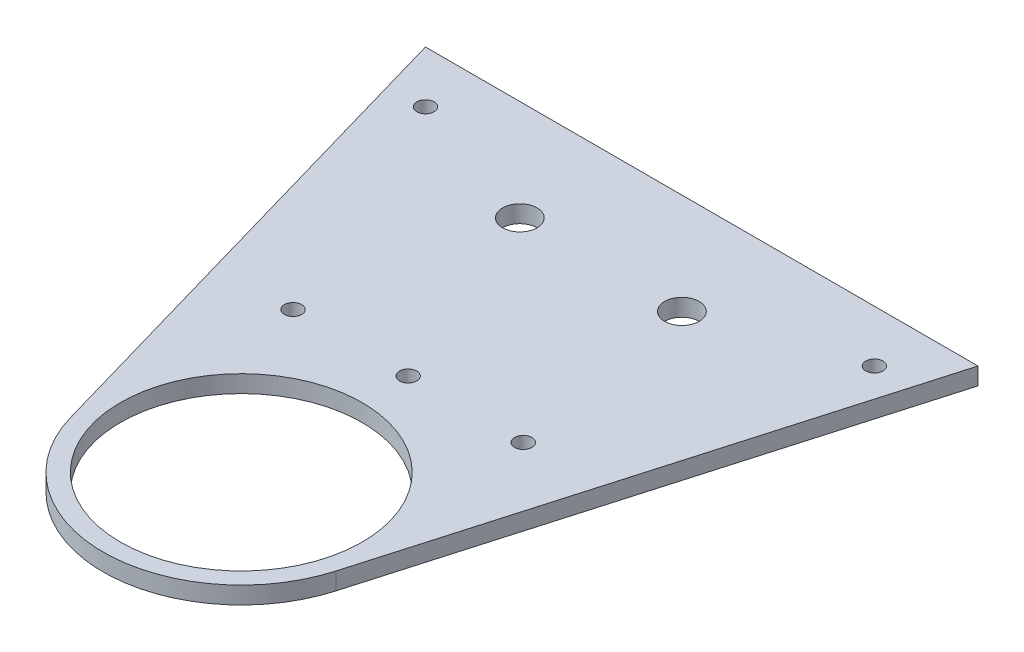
from build123d import *

# Parameters (mm, degrees)
SKETCH_1_R          = 21
EXTRUDE_1_DEPTH     = 3
SKETCH_4_R          = 3
CUT_EXTRUDE_3_DEPTH = 36
SKETCH_5_R          = 1.5
CUT_EXTRUDE_5_DEPTH = 10


with BuildPart() as part:
    # Sketch 1 → Extrude 1 (new body)
    with BuildSketch(Plane(origin=(0, 0, 0), x_dir=(1, 0, 0), z_dir=(0, 1, 0))):
        with BuildLine():
            Line((0, 80), (-48, 80))
            Line((-48, 80), (-23.063695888, -6.638217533))
            ThreePointArc((-23.063695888, -6.638217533), (0, -24), (23.063695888, -6.638217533))
            Line((23.063695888, -6.638217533), (48, 80))
            Line((48, 80), (0, 80))
        make_face()
        with Locations(Location((0, 0, 0), (0, 0, 270))):
            Circle(SKETCH_1_R, mode=Mode.SUBTRACT)
    extrude(amount=EXTRUDE_1_DEPTH)

    # Sketch 4 → Cut-Extrude 3 (cut)
    with BuildSketch(Plane(origin=(0, 3, 0), x_dir=(1, 0, 0), z_dir=(0, 1, 0))):
        with Locations(Location((-14.091100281, 62.490589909, 0), (0, 0, 270))):
            Circle(SKETCH_4_R)
        with Locations(Location((14.061235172, 62.490589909, 0), (0, 0, 270))):
            Circle(SKETCH_4_R)
    extrude(amount=-CUT_EXTRUDE_3_DEPTH, mode=Mode.SUBTRACT)

    # Sketch 5 → Cut-Extrude 5 (cut)
    with BuildSketch(Plane.XZ):
        with Locations(Location((0, -28.989897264, 0), (0, 0, 270))):
            Circle(SKETCH_5_R)
        with Locations(Location((20, -28.989897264, 0), (0, 0, 270))):
            Circle(SKETCH_5_R)
        with Locations(Location((-20, -28.989897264, 0), (0, 0, 270))):
            Circle(SKETCH_5_R)
        with Locations(Location((39, -71, 0), (0, 0, 270))):
            Circle(SKETCH_5_R)
        with Locations(Location((-39, -71, 0), (0, 0, 270))):
            Circle(SKETCH_5_R)
    extrude(amount=-CUT_EXTRUDE_5_DEPTH, mode=Mode.SUBTRACT)


solid = part.part
